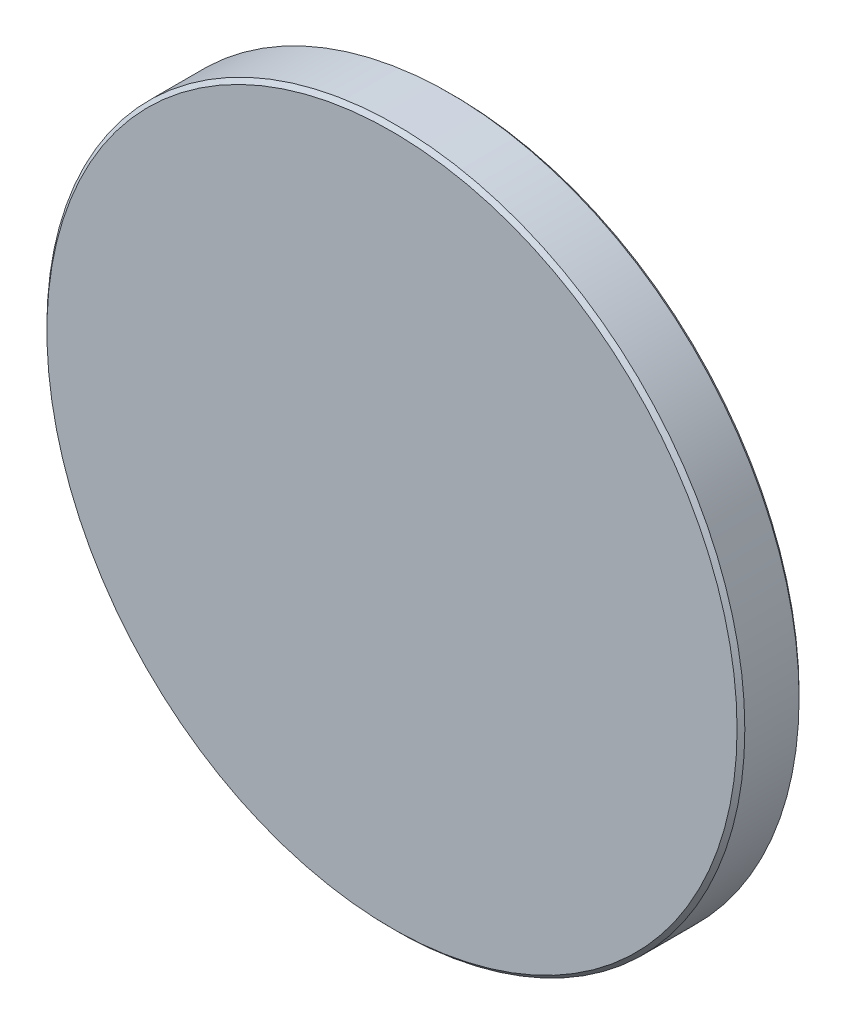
ISO-10303-21;
HEADER;
FILE_DESCRIPTION(('STEP AP214'),'2;1');
FILE_NAME('part.step','',(''),(''),'','','');
FILE_SCHEMA(('AUTOMOTIVE_DESIGN { 1 0 10303 214 1 1 1 1 }'));
ENDSEC;
DATA;
#1=APPLICATION_CONTEXT('core data for automotive mechanical design processes');
#2=APPLICATION_PROTOCOL_DEFINITION('international standard','automotive_design',2000,#1);
#3=PRODUCT_CONTEXT('',#1,'mechanical');
#4=PRODUCT('Part','Part','',(#3));
#5=PRODUCT_RELATED_PRODUCT_CATEGORY('part','',(#4));
#6=PRODUCT_DEFINITION_FORMATION('','',#4);
#7=PRODUCT_DEFINITION_CONTEXT('part definition',#1,'design');
#8=PRODUCT_DEFINITION('design','',#6,#7);
#9=PRODUCT_DEFINITION_SHAPE('','',#8);
#10=(LENGTH_UNIT() NAMED_UNIT(*) SI_UNIT(.MILLI.,.METRE.));
#11=(NAMED_UNIT(*) PLANE_ANGLE_UNIT() SI_UNIT($,.RADIAN.));
#12=(NAMED_UNIT(*) SI_UNIT($,.STERADIAN.) SOLID_ANGLE_UNIT());
#13=UNCERTAINTY_MEASURE_WITH_UNIT(LENGTH_MEASURE(1.E-05),#10,'distance_accuracy_value','');
#14=(GEOMETRIC_REPRESENTATION_CONTEXT(3) GLOBAL_UNCERTAINTY_ASSIGNED_CONTEXT((#13)) GLOBAL_UNIT_ASSIGNED_CONTEXT((#10,
#11,#12)) REPRESENTATION_CONTEXT('',''));
#15=CARTESIAN_POINT('',(0.,0.,0.));
#16=DIRECTION('',(0.,0.,1.));
#17=DIRECTION('',(1.,0.,0.));
#18=AXIS2_PLACEMENT_3D('',#15,#16,#17);
#19=CARTESIAN_POINT('',(0.,44.5,4.));
#20=DIRECTION('',(0.,0.,-1.));
#21=DIRECTION('',(-1.,0.,0.));
#22=AXIS2_PLACEMENT_3D('',#19,#20,#21);
#23=PLANE('',#22);
#24=CARTESIAN_POINT('',(0.,0.,4.));
#25=DIRECTION('',(0.,0.,1.));
#26=DIRECTION('',(1.,0.,0.));
#27=AXIS2_PLACEMENT_3D('',#24,#25,#26);
#28=CIRCLE('',#27,44.5);
#29=CARTESIAN_POINT('',(44.5,0.,4.));
#30=VERTEX_POINT('',#29);
#31=EDGE_CURVE('E46',#30,#30,#28,.T.);
#32=ORIENTED_EDGE('',*,*,#31,.T.);
#33=EDGE_LOOP('',(#32));
#34=FACE_BOUND('',#33,.T.);
#35=ADVANCED_FACE('F32',(#34),#23,.F.);
#36=CARTESIAN_POINT('',(0.,0.,-4.));
#37=DIRECTION('',(0.,0.,1.));
#38=DIRECTION('',(1.,0.,0.));
#39=AXIS2_PLACEMENT_3D('',#36,#37,#38);
#40=PLANE('',#39);
#41=CARTESIAN_POINT('',(0.,0.,-4.));
#42=DIRECTION('',(0.,0.,1.));
#43=DIRECTION('',(1.,0.,0.));
#44=AXIS2_PLACEMENT_3D('',#41,#42,#43);
#45=CIRCLE('',#44,44.5);
#46=CARTESIAN_POINT('',(44.5,0.,-4.));
#47=VERTEX_POINT('',#46);
#48=EDGE_CURVE('E10',#47,#47,#45,.T.);
#49=ORIENTED_EDGE('',*,*,#48,.F.);
#50=EDGE_LOOP('',(#49));
#51=FACE_BOUND('',#50,.T.);
#52=ADVANCED_FACE('F66',(#51),#40,.F.);
#53=CARTESIAN_POINT('',(0.,0.,-4.));
#54=DIRECTION('',(0.,0.,1.));
#55=DIRECTION('',(1.,0.,0.));
#56=AXIS2_PLACEMENT_3D('',#53,#54,#55);
#57=CONICAL_SURFACE('',#56,44.5,0.785398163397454);
#58=CARTESIAN_POINT('',(0.,0.,-3.5));
#59=DIRECTION('',(0.,0.,1.));
#60=DIRECTION('',(1.,0.,0.));
#61=AXIS2_PLACEMENT_3D('',#58,#59,#60);
#62=CIRCLE('',#61,45.);
#63=CARTESIAN_POINT('',(45.,0.,-3.5));
#64=VERTEX_POINT('',#63);
#65=EDGE_CURVE('E38',#64,#64,#62,.T.);
#66=ORIENTED_EDGE('',*,*,#65,.F.);
#67=EDGE_LOOP('',(#66));
#68=FACE_BOUND('',#67,.T.);
#69=ORIENTED_EDGE('',*,*,#48,.T.);
#70=EDGE_LOOP('',(#69));
#71=FACE_BOUND('',#70,.T.);
#72=ADVANCED_FACE('F61',(#68,#71),#57,.T.);
#73=CARTESIAN_POINT('',(0.,0.,-4.));
#74=DIRECTION('',(0.,0.,1.));
#75=DIRECTION('',(1.,0.,0.));
#76=AXIS2_PLACEMENT_3D('',#73,#74,#75);
#77=CYLINDRICAL_SURFACE('',#76,45.);
#78=CARTESIAN_POINT('',(0.,0.,3.49999999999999));
#79=DIRECTION('',(0.,0.,1.));
#80=DIRECTION('',(1.,0.,0.));
#81=AXIS2_PLACEMENT_3D('',#78,#79,#80);
#82=CIRCLE('',#81,45.);
#83=CARTESIAN_POINT('',(45.,0.,3.49999999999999));
#84=VERTEX_POINT('',#83);
#85=EDGE_CURVE('E42',#84,#84,#82,.T.);
#86=ORIENTED_EDGE('',*,*,#85,.F.);
#87=EDGE_LOOP('',(#86));
#88=FACE_BOUND('',#87,.T.);
#89=ORIENTED_EDGE('',*,*,#65,.T.);
#90=EDGE_LOOP('',(#89));
#91=FACE_BOUND('',#90,.T.);
#92=ADVANCED_FACE('F56',(#88,#91),#77,.T.);
#93=CARTESIAN_POINT('',(0.,0.,3.49999999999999));
#94=DIRECTION('',(0.,0.,-1.));
#95=DIRECTION('',(-1.,0.,0.));
#96=AXIS2_PLACEMENT_3D('',#93,#94,#95);
#97=CONICAL_SURFACE('',#96,45.,0.785398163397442);
#98=ORIENTED_EDGE('',*,*,#31,.F.);
#99=EDGE_LOOP('',(#98));
#100=FACE_BOUND('',#99,.T.);
#101=ORIENTED_EDGE('',*,*,#85,.T.);
#102=EDGE_LOOP('',(#101));
#103=FACE_BOUND('',#102,.T.);
#104=ADVANCED_FACE('F53',(#100,#103),#97,.T.);
#105=CLOSED_SHELL('',(#35,#52,#72,#92,#104));
#106=MANIFOLD_SOLID_BREP('B2',#105);
#107=ADVANCED_BREP_SHAPE_REPRESENTATION('',(#18,#106),#14);
#108=SHAPE_DEFINITION_REPRESENTATION(#9,#107);
ENDSEC;
END-ISO-10303-21;
